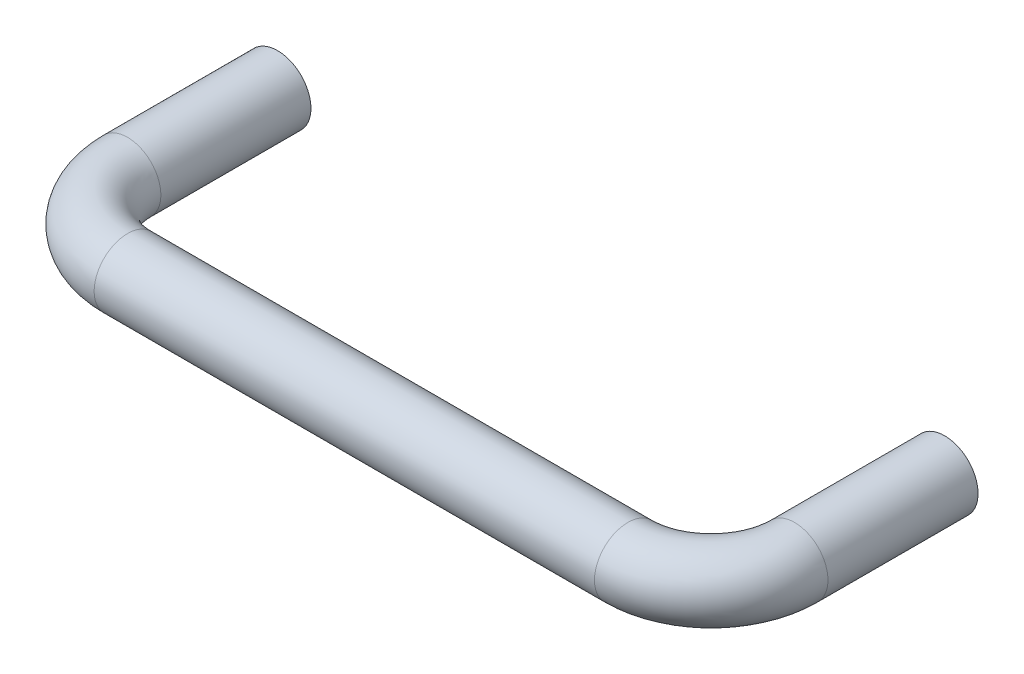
ISO-10303-21;
HEADER;
FILE_DESCRIPTION(('STEP AP214'),'2;1');
FILE_NAME('part.step','',(''),(''),'','','');
FILE_SCHEMA(('AUTOMOTIVE_DESIGN { 1 0 10303 214 1 1 1 1 }'));
ENDSEC;
DATA;
#1=APPLICATION_CONTEXT('core data for automotive mechanical design processes');
#2=APPLICATION_PROTOCOL_DEFINITION('international standard','automotive_design',2000,#1);
#3=PRODUCT_CONTEXT('',#1,'mechanical');
#4=PRODUCT('Part','Part','',(#3));
#5=PRODUCT_RELATED_PRODUCT_CATEGORY('part','',(#4));
#6=PRODUCT_DEFINITION_FORMATION('','',#4);
#7=PRODUCT_DEFINITION_CONTEXT('part definition',#1,'design');
#8=PRODUCT_DEFINITION('design','',#6,#7);
#9=PRODUCT_DEFINITION_SHAPE('','',#8);
#10=(LENGTH_UNIT() NAMED_UNIT(*) SI_UNIT(.MILLI.,.METRE.));
#11=(NAMED_UNIT(*) PLANE_ANGLE_UNIT() SI_UNIT($,.RADIAN.));
#12=(NAMED_UNIT(*) SI_UNIT($,.STERADIAN.) SOLID_ANGLE_UNIT());
#13=UNCERTAINTY_MEASURE_WITH_UNIT(LENGTH_MEASURE(1.E-05),#10,'distance_accuracy_value','');
#14=(GEOMETRIC_REPRESENTATION_CONTEXT(3) GLOBAL_UNCERTAINTY_ASSIGNED_CONTEXT((#13)) GLOBAL_UNIT_ASSIGNED_CONTEXT((#10,
#11,#12)) REPRESENTATION_CONTEXT('',''));
#15=CARTESIAN_POINT('',(0.,0.,0.));
#16=DIRECTION('',(0.,0.,1.));
#17=DIRECTION('',(1.,0.,0.));
#18=AXIS2_PLACEMENT_3D('',#15,#16,#17);
#19=CARTESIAN_POINT('',(100.,0.,22.5));
#20=DIRECTION('',(0.,0.,-1.));
#21=DIRECTION('',(0.,1.,0.));
#22=AXIS2_PLACEMENT_3D('',#19,#20,#21);
#23=CYLINDRICAL_SURFACE('',#22,5.);
#24=CARTESIAN_POINT('',(100.,0.,0.));
#25=DIRECTION('',(0.,0.,-1.));
#26=DIRECTION('',(-1.,0.,0.));
#27=AXIS2_PLACEMENT_3D('',#24,#25,#26);
#28=CIRCLE('',#27,5.);
#29=CARTESIAN_POINT('',(95.,0.,0.));
#30=VERTEX_POINT('',#29);
#31=EDGE_CURVE('E50',#30,#30,#28,.T.);
#32=ORIENTED_EDGE('',*,*,#31,.F.);
#33=EDGE_LOOP('',(#32));
#34=FACE_BOUND('',#33,.T.);
#35=CARTESIAN_POINT('',(100.,0.,22.5));
#36=DIRECTION('',(0.,0.,-1.));
#37=DIRECTION('',(0.,-1.,0.));
#38=AXIS2_PLACEMENT_3D('',#35,#36,#37);
#39=CIRCLE('',#38,5.);
#40=CARTESIAN_POINT('',(105.,0.,22.5));
#41=VERTEX_POINT('',#40);
#42=EDGE_CURVE('E32',#41,#41,#39,.T.);
#43=ORIENTED_EDGE('',*,*,#42,.T.);
#44=EDGE_LOOP('',(#43));
#45=FACE_BOUND('',#44,.T.);
#46=ADVANCED_FACE('F12',(#34,#45),#23,.T.);
#47=CARTESIAN_POINT('',(87.5,0.,22.5));
#48=DIRECTION('',(0.,1.,0.));
#49=DIRECTION('',(-1.,0.,0.));
#50=AXIS2_PLACEMENT_3D('',#47,#48,#49);
#51=TOROIDAL_SURFACE('',#50,12.5,5.);
#52=CARTESIAN_POINT('',(87.5,0.,35.));
#53=DIRECTION('',(1.,0.,0.));
#54=DIRECTION('',(0.,-1.,0.));
#55=AXIS2_PLACEMENT_3D('',#52,#53,#54);
#56=CIRCLE('',#55,5.);
#57=CARTESIAN_POINT('',(87.5,0.,40.));
#58=VERTEX_POINT('',#57);
#59=EDGE_CURVE('E35',#58,#58,#56,.T.);
#60=CARTESIAN_POINT('',(87.5,0.,22.5));
#61=DIRECTION('',(0.,1.,0.));
#62=DIRECTION('',(-1.,0.,0.));
#63=AXIS2_PLACEMENT_3D('',#60,#61,#62);
#64=CIRCLE('',#63,17.5);
#65=EDGE_CURVE('',#58,#41,#64,.T.);
#66=ORIENTED_EDGE('',*,*,#59,.T.);
#67=ORIENTED_EDGE('',*,*,#42,.F.);
#68=ORIENTED_EDGE('',*,*,#65,.T.);
#69=ORIENTED_EDGE('',*,*,#65,.F.);
#70=EDGE_LOOP('',(#66,#68,#67,#69));
#71=FACE_BOUND('',#70,.T.);
#72=ADVANCED_FACE('F75',(#71),#51,.T.);
#73=CARTESIAN_POINT('',(12.5,0.,35.));
#74=DIRECTION('',(1.,0.,0.));
#75=DIRECTION('',(0.,0.,1.));
#76=AXIS2_PLACEMENT_3D('',#73,#74,#75);
#77=CYLINDRICAL_SURFACE('',#76,5.);
#78=CARTESIAN_POINT('',(12.5,0.,35.));
#79=DIRECTION('',(1.,0.,0.));
#80=DIRECTION('',(0.,-1.,0.));
#81=AXIS2_PLACEMENT_3D('',#78,#79,#80);
#82=CIRCLE('',#81,5.);
#83=CARTESIAN_POINT('',(12.5,0.,40.));
#84=VERTEX_POINT('',#83);
#85=EDGE_CURVE('E38',#84,#84,#82,.T.);
#86=ORIENTED_EDGE('',*,*,#85,.T.);
#87=EDGE_LOOP('',(#86));
#88=FACE_BOUND('',#87,.T.);
#89=ORIENTED_EDGE('',*,*,#59,.F.);
#90=EDGE_LOOP('',(#89));
#91=FACE_BOUND('',#90,.T.);
#92=ADVANCED_FACE('F69',(#88,#91),#77,.T.);
#93=CARTESIAN_POINT('',(12.5,0.,22.5));
#94=DIRECTION('',(0.,1.,0.));
#95=DIRECTION('',(-1.,0.,0.));
#96=AXIS2_PLACEMENT_3D('',#93,#94,#95);
#97=TOROIDAL_SURFACE('',#96,12.5,5.);
#98=CARTESIAN_POINT('',(0.,0.,22.5));
#99=DIRECTION('',(0.,0.,1.));
#100=DIRECTION('',(0.,-1.,0.));
#101=AXIS2_PLACEMENT_3D('',#98,#99,#100);
#102=CIRCLE('',#101,5.);
#103=CARTESIAN_POINT('',(-5.,0.,22.5));
#104=VERTEX_POINT('',#103);
#105=EDGE_CURVE('E41',#104,#104,#102,.T.);
#106=CARTESIAN_POINT('',(12.5,0.,22.5));
#107=DIRECTION('',(0.,1.,0.));
#108=DIRECTION('',(-1.,0.,0.));
#109=AXIS2_PLACEMENT_3D('',#106,#107,#108);
#110=CIRCLE('',#109,17.5);
#111=EDGE_CURVE('',#104,#84,#110,.T.);
#112=ORIENTED_EDGE('',*,*,#105,.T.);
#113=ORIENTED_EDGE('',*,*,#85,.F.);
#114=ORIENTED_EDGE('',*,*,#111,.T.);
#115=ORIENTED_EDGE('',*,*,#111,.F.);
#116=EDGE_LOOP('',(#112,#114,#113,#115));
#117=FACE_BOUND('',#116,.T.);
#118=ADVANCED_FACE('F63',(#117),#97,.T.);
#119=CARTESIAN_POINT('',(0.,0.,22.5));
#120=DIRECTION('',(0.,0.,-1.));
#121=DIRECTION('',(1.,0.,0.));
#122=AXIS2_PLACEMENT_3D('',#119,#120,#121);
#123=CYLINDRICAL_SURFACE('',#122,5.);
#124=CARTESIAN_POINT('',(0.,0.,0.));
#125=DIRECTION('',(0.,0.,-1.));
#126=DIRECTION('',(-1.,0.,0.));
#127=AXIS2_PLACEMENT_3D('',#124,#125,#126);
#128=CIRCLE('',#127,5.);
#129=CARTESIAN_POINT('',(-5.00000000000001,0.,0.));
#130=VERTEX_POINT('',#129);
#131=EDGE_CURVE('E53',#130,#130,#128,.T.);
#132=ORIENTED_EDGE('',*,*,#131,.F.);
#133=EDGE_LOOP('',(#132));
#134=FACE_BOUND('',#133,.T.);
#135=ORIENTED_EDGE('',*,*,#105,.F.);
#136=EDGE_LOOP('',(#135));
#137=FACE_BOUND('',#136,.T.);
#138=ADVANCED_FACE('F59',(#134,#137),#123,.T.);
#139=CARTESIAN_POINT('',(102.5,0.,10.));
#140=DIRECTION('',(0.,0.,-1.));
#141=DIRECTION('',(-1.,0.,0.));
#142=AXIS2_PLACEMENT_3D('',#139,#140,#141);
#143=PLANE('',#142);
#144=CARTESIAN_POINT('',(100.,0.,10.));
#145=DIRECTION('',(0.,0.,-1.));
#146=DIRECTION('',(1.,0.,0.));
#147=AXIS2_PLACEMENT_3D('',#144,#145,#146);
#148=CIRCLE('',#147,2.5);
#149=CARTESIAN_POINT('',(102.5,0.,10.));
#150=VERTEX_POINT('',#149);
#151=EDGE_CURVE('E47',#150,#150,#148,.T.);
#152=ORIENTED_EDGE('',*,*,#151,.T.);
#153=EDGE_LOOP('',(#152));
#154=FACE_BOUND('',#153,.T.);
#155=ADVANCED_FACE('F62',(#154),#143,.T.);
#156=CARTESIAN_POINT('',(100.,0.,13.6933830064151));
#157=DIRECTION('',(0.,0.,1.));
#158=DIRECTION('',(1.,0.,0.));
#159=AXIS2_PLACEMENT_3D('',#156,#157,#158);
#160=CYLINDRICAL_SURFACE('',#159,2.5);
#161=CARTESIAN_POINT('',(100.,0.,0.45000000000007));
#162=DIRECTION('',(0.,0.,-1.));
#163=DIRECTION('',(-1.,0.,0.));
#164=AXIS2_PLACEMENT_3D('',#161,#162,#163);
#165=CIRCLE('',#164,2.5);
#166=CARTESIAN_POINT('',(97.5,0.,0.45000000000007));
#167=VERTEX_POINT('',#166);
#168=EDGE_CURVE('E19',#167,#167,#165,.T.);
#169=ORIENTED_EDGE('',*,*,#168,.T.);
#170=EDGE_LOOP('',(#169));
#171=FACE_BOUND('',#170,.T.);
#172=ORIENTED_EDGE('',*,*,#151,.F.);
#173=EDGE_LOOP('',(#172));
#174=FACE_BOUND('',#173,.T.);
#175=ADVANCED_FACE('F121',(#171,#174),#160,.F.);
#176=CARTESIAN_POINT('',(115.344472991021,-15.0954387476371,0.));
#177=DIRECTION('',(0.,0.,-1.));
#178=DIRECTION('',(-1.,0.,0.));
#179=AXIS2_PLACEMENT_3D('',#176,#177,#178);
#180=PLANE('',#179);
#181=CARTESIAN_POINT('',(100.,0.,0.));
#182=DIRECTION('',(0.,0.,-1.));
#183=DIRECTION('',(-1.,0.,0.));
#184=AXIS2_PLACEMENT_3D('',#181,#182,#183);
#185=CIRCLE('',#184,2.95);
#186=CARTESIAN_POINT('',(97.05,0.,0.));
#187=VERTEX_POINT('',#186);
#188=EDGE_CURVE('E8',#187,#187,#185,.F.);
#189=ORIENTED_EDGE('',*,*,#188,.T.);
#190=EDGE_LOOP('',(#189));
#191=FACE_BOUND('',#190,.T.);
#192=ORIENTED_EDGE('',*,*,#31,.T.);
#193=EDGE_LOOP('',(#192));
#194=FACE_BOUND('',#193,.T.);
#195=ADVANCED_FACE('F104',(#191,#194),#180,.T.);
#196=CARTESIAN_POINT('',(-2.5,0.,10.));
#197=DIRECTION('',(0.,0.,-1.));
#198=DIRECTION('',(1.,0.,0.));
#199=AXIS2_PLACEMENT_3D('',#196,#197,#198);
#200=PLANE('',#199);
#201=CARTESIAN_POINT('',(0.,0.,10.));
#202=DIRECTION('',(0.,0.,1.));
#203=DIRECTION('',(-1.,0.,0.));
#204=AXIS2_PLACEMENT_3D('',#201,#202,#203);
#205=CIRCLE('',#204,2.5);
#206=CARTESIAN_POINT('',(-2.50000000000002,0.,10.));
#207=VERTEX_POINT('',#206);
#208=EDGE_CURVE('E44',#207,#207,#205,.T.);
#209=ORIENTED_EDGE('',*,*,#208,.F.);
#210=EDGE_LOOP('',(#209));
#211=FACE_BOUND('',#210,.T.);
#212=ADVANCED_FACE('F111',(#211),#200,.T.);
#213=CARTESIAN_POINT('',(0.,0.,13.6933830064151));
#214=DIRECTION('',(0.,0.,1.));
#215=DIRECTION('',(-1.,0.,0.));
#216=AXIS2_PLACEMENT_3D('',#213,#214,#215);
#217=CYLINDRICAL_SURFACE('',#216,2.5);
#218=CARTESIAN_POINT('',(0.,0.,0.449999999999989));
#219=DIRECTION('',(0.,0.,-1.));
#220=DIRECTION('',(-1.,0.,0.));
#221=AXIS2_PLACEMENT_3D('',#218,#219,#220);
#222=CIRCLE('',#221,2.5);
#223=CARTESIAN_POINT('',(-2.5,0.,0.449999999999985));
#224=VERTEX_POINT('',#223);
#225=EDGE_CURVE('E27',#224,#224,#222,.T.);
#226=ORIENTED_EDGE('',*,*,#225,.T.);
#227=EDGE_LOOP('',(#226));
#228=FACE_BOUND('',#227,.T.);
#229=ORIENTED_EDGE('',*,*,#208,.T.);
#230=EDGE_LOOP('',(#229));
#231=FACE_BOUND('',#230,.T.);
#232=ADVANCED_FACE('F101',(#228,#231),#217,.F.);
#233=CARTESIAN_POINT('',(0.,0.,0.));
#234=DIRECTION('',(0.,0.,-1.));
#235=DIRECTION('',(-1.,0.,0.));
#236=AXIS2_PLACEMENT_3D('',#233,#234,#235);
#237=CIRCLE('',#236,2.95);
#238=CARTESIAN_POINT('',(-2.95,0.,0.));
#239=VERTEX_POINT('',#238);
#240=EDGE_CURVE('E23',#239,#239,#237,.F.);
#241=ORIENTED_EDGE('',*,*,#240,.T.);
#242=EDGE_LOOP('',(#241));
#243=FACE_BOUND('',#242,.T.);
#244=ORIENTED_EDGE('',*,*,#131,.T.);
#245=EDGE_LOOP('',(#244));
#246=FACE_BOUND('',#245,.T.);
#247=ADVANCED_FACE('F57',(#243,#246),#180,.T.);
#248=CARTESIAN_POINT('',(0.,0.,0.449999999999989));
#249=DIRECTION('',(0.,0.,-1.));
#250=DIRECTION('',(-1.,0.,0.));
#251=AXIS2_PLACEMENT_3D('',#248,#249,#250);
#252=CONICAL_SURFACE('',#251,2.5,0.785398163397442);
#253=ORIENTED_EDGE('',*,*,#240,.F.);
#254=EDGE_LOOP('',(#253));
#255=FACE_BOUND('',#254,.T.);
#256=ORIENTED_EDGE('',*,*,#225,.F.);
#257=EDGE_LOOP('',(#256));
#258=FACE_BOUND('',#257,.T.);
#259=ADVANCED_FACE('F92',(#255,#258),#252,.F.);
#260=CARTESIAN_POINT('',(100.,0.,0.450000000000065));
#261=DIRECTION('',(0.,0.,-1.));
#262=DIRECTION('',(-1.,0.,0.));
#263=AXIS2_PLACEMENT_3D('',#260,#261,#262);
#264=CONICAL_SURFACE('',#263,2.5,0.785398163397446);
#265=ORIENTED_EDGE('',*,*,#188,.F.);
#266=EDGE_LOOP('',(#265));
#267=FACE_BOUND('',#266,.T.);
#268=ORIENTED_EDGE('',*,*,#168,.F.);
#269=EDGE_LOOP('',(#268));
#270=FACE_BOUND('',#269,.T.);
#271=ADVANCED_FACE('F14',(#267,#270),#264,.F.);
#272=CLOSED_SHELL('',(#46,#72,#92,#118,#138,#155,#175,#195,#212,#232,#247,#259,#271));
#273=MANIFOLD_SOLID_BREP('B1',#272);
#274=ADVANCED_BREP_SHAPE_REPRESENTATION('',(#18,#273),#14);
#275=SHAPE_DEFINITION_REPRESENTATION(#9,#274);
ENDSEC;
END-ISO-10303-21;
